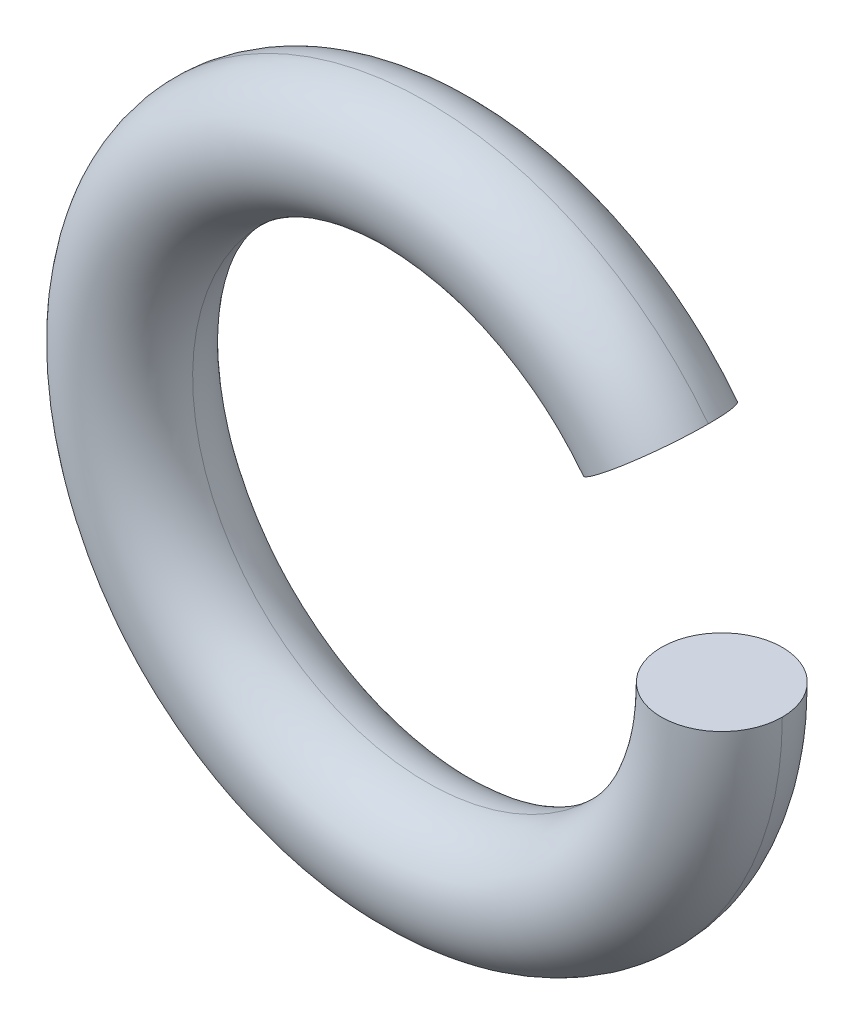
from build123d import *

# Parameters (mm, degrees)
SKETCH2_R = 0.4


with BuildPart() as part:
    # Sweep1: sweep along a path in Sketch1
    with BuildLine(Plane.XY) as sweep1_path:
        ThreePointArc((1.227419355, 0.946541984), (-1.467140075, -0.5), (1.55, 0))
    # Sketch2 → Sweep1 (sweep)
    with BuildSketch(Plane(origin=(0, 0, 0), x_dir=(1, 0, 0), z_dir=(0, 1, 0))):
        with Locations((1.95, 0)):
            Circle(SKETCH2_R)
    sweep(path=sweep1_path.line)


solid = part.part
